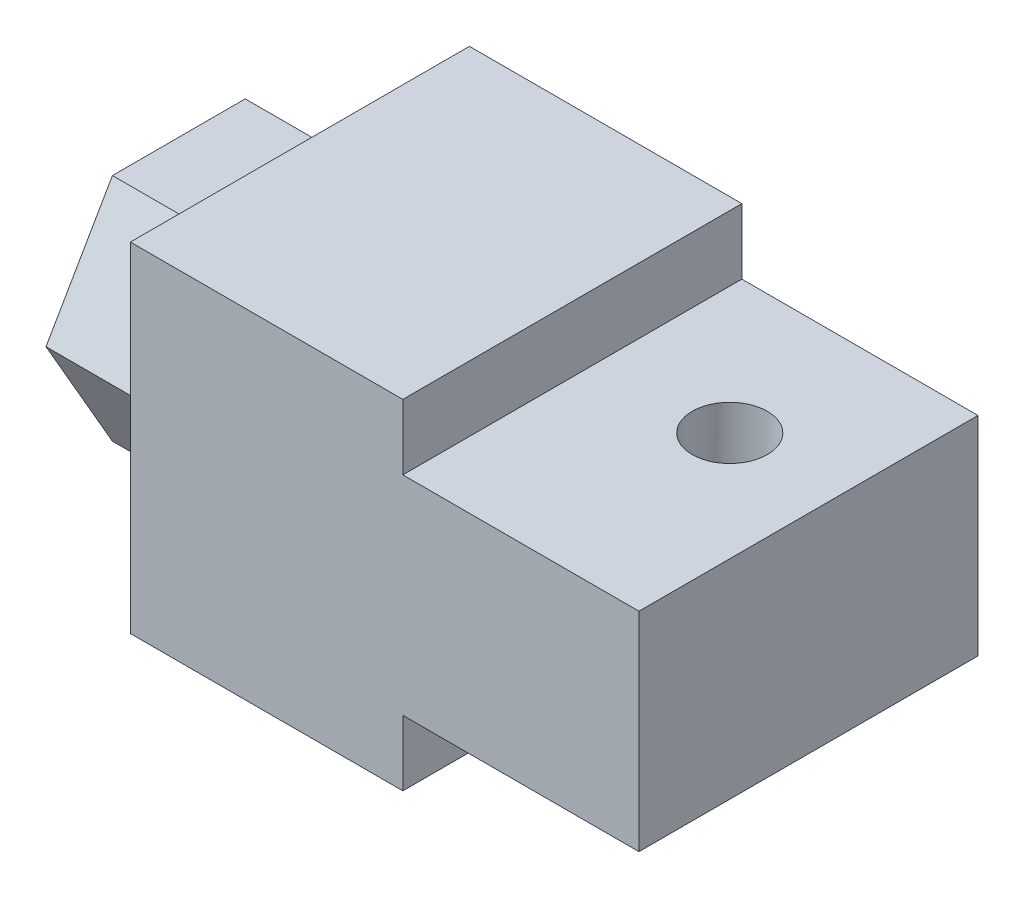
ISO-10303-21;
HEADER;
FILE_DESCRIPTION(('STEP AP214'),'2;1');
FILE_NAME('part.step','',(''),(''),'','','');
FILE_SCHEMA(('AUTOMOTIVE_DESIGN { 1 0 10303 214 1 1 1 1 }'));
ENDSEC;
DATA;
#1=APPLICATION_CONTEXT('core data for automotive mechanical design processes');
#2=APPLICATION_PROTOCOL_DEFINITION('international standard','automotive_design',2000,#1);
#3=PRODUCT_CONTEXT('',#1,'mechanical');
#4=PRODUCT('Part','Part','',(#3));
#5=PRODUCT_RELATED_PRODUCT_CATEGORY('part','',(#4));
#6=PRODUCT_DEFINITION_FORMATION('','',#4);
#7=PRODUCT_DEFINITION_CONTEXT('part definition',#1,'design');
#8=PRODUCT_DEFINITION('design','',#6,#7);
#9=PRODUCT_DEFINITION_SHAPE('','',#8);
#10=(LENGTH_UNIT() NAMED_UNIT(*) SI_UNIT(.MILLI.,.METRE.));
#11=(NAMED_UNIT(*) PLANE_ANGLE_UNIT() SI_UNIT($,.RADIAN.));
#12=(NAMED_UNIT(*) SI_UNIT($,.STERADIAN.) SOLID_ANGLE_UNIT());
#13=UNCERTAINTY_MEASURE_WITH_UNIT(LENGTH_MEASURE(1.E-05),#10,'distance_accuracy_value','');
#14=(GEOMETRIC_REPRESENTATION_CONTEXT(3) GLOBAL_UNCERTAINTY_ASSIGNED_CONTEXT((#13)) GLOBAL_UNIT_ASSIGNED_CONTEXT((#10,
#11,#12)) REPRESENTATION_CONTEXT('',''));
#15=CARTESIAN_POINT('',(0.,0.,0.));
#16=DIRECTION('',(0.,0.,1.));
#17=DIRECTION('',(1.,0.,0.));
#18=AXIS2_PLACEMENT_3D('',#15,#16,#17);
#19=CARTESIAN_POINT('',(42.,14.,14.));
#20=DIRECTION('',(0.,1.,0.));
#21=DIRECTION('',(0.,0.,-1.));
#22=AXIS2_PLACEMENT_3D('',#19,#20,#21);
#23=PLANE('',#22);
#24=DIRECTION('',(-1.,0.,0.));
#25=VECTOR('',#24,1.);
#26=CARTESIAN_POINT('',(42.,14.,14.));
#27=LINE('',#26,#25);
#28=CARTESIAN_POINT('',(22.5,14.,14.));
#29=VERTEX_POINT('',#28);
#30=CARTESIAN_POINT('',(0.,14.,14.));
#31=VERTEX_POINT('',#30);
#32=EDGE_CURVE('E23',#29,#31,#27,.T.);
#33=ORIENTED_EDGE('',*,*,#32,.F.);
#34=DIRECTION('',(0.,0.,-1.));
#35=VECTOR('',#34,1.);
#36=CARTESIAN_POINT('',(22.5,14.,14.));
#37=LINE('',#36,#35);
#38=CARTESIAN_POINT('',(22.5,14.,-14.));
#39=VERTEX_POINT('',#38);
#40=EDGE_CURVE('E193',#29,#39,#37,.T.);
#41=ORIENTED_EDGE('',*,*,#40,.T.);
#42=DIRECTION('',(-1.,0.,0.));
#43=VECTOR('',#42,1.);
#44=CARTESIAN_POINT('',(42.,14.,-14.));
#45=LINE('',#44,#43);
#46=CARTESIAN_POINT('',(0.,14.,-14.));
#47=VERTEX_POINT('',#46);
#48=EDGE_CURVE('E227',#39,#47,#45,.T.);
#49=ORIENTED_EDGE('',*,*,#48,.T.);
#50=DIRECTION('',(0.,0.,-1.));
#51=VECTOR('',#50,1.);
#52=CARTESIAN_POINT('',(0.,14.,14.));
#53=LINE('',#52,#51);
#54=EDGE_CURVE('E210',#31,#47,#53,.T.);
#55=ORIENTED_EDGE('',*,*,#54,.F.);
#56=EDGE_LOOP('',(#33,#41,#49,#55));
#57=FACE_BOUND('',#56,.T.);
#58=ADVANCED_FACE('F14',(#57),#23,.T.);
#59=CARTESIAN_POINT('',(42.,14.,14.));
#60=DIRECTION('',(0.,0.,-1.));
#61=DIRECTION('',(0.,-1.,0.));
#62=AXIS2_PLACEMENT_3D('',#59,#60,#61);
#63=PLANE('',#62);
#64=DIRECTION('',(0.,1.,0.));
#65=VECTOR('',#64,1.);
#66=CARTESIAN_POINT('',(22.5,8.6,14.));
#67=LINE('',#66,#65);
#68=CARTESIAN_POINT('',(22.5,8.6,14.));
#69=VERTEX_POINT('',#68);
#70=EDGE_CURVE('E181',#69,#29,#67,.T.);
#71=ORIENTED_EDGE('',*,*,#70,.T.);
#72=ORIENTED_EDGE('',*,*,#32,.T.);
#73=DIRECTION('',(0.,-1.,0.));
#74=VECTOR('',#73,1.);
#75=CARTESIAN_POINT('',(0.,14.,14.));
#76=LINE('',#75,#74);
#77=CARTESIAN_POINT('',(0.,-14.,14.));
#78=VERTEX_POINT('',#77);
#79=EDGE_CURVE('E219',#31,#78,#76,.T.);
#80=ORIENTED_EDGE('',*,*,#79,.T.);
#81=DIRECTION('',(-1.,0.,0.));
#82=VECTOR('',#81,1.);
#83=CARTESIAN_POINT('',(42.,-14.,14.));
#84=LINE('',#83,#82);
#85=CARTESIAN_POINT('',(22.5,-14.,14.));
#86=VERTEX_POINT('',#85);
#87=EDGE_CURVE('E231',#86,#78,#84,.T.);
#88=ORIENTED_EDGE('',*,*,#87,.F.);
#89=DIRECTION('',(0.,-1.,0.));
#90=VECTOR('',#89,1.);
#91=CARTESIAN_POINT('',(22.5,-8.6,14.));
#92=LINE('',#91,#90);
#93=CARTESIAN_POINT('',(22.5,-8.6,14.));
#94=VERTEX_POINT('',#93);
#95=EDGE_CURVE('E196',#94,#86,#92,.T.);
#96=ORIENTED_EDGE('',*,*,#95,.F.);
#97=DIRECTION('',(1.,0.,0.));
#98=VECTOR('',#97,1.);
#99=CARTESIAN_POINT('',(22.5,-8.6,14.));
#100=LINE('',#99,#98);
#101=CARTESIAN_POINT('',(42.,-8.6,14.));
#102=VERTEX_POINT('',#101);
#103=EDGE_CURVE('E198',#94,#102,#100,.T.);
#104=ORIENTED_EDGE('',*,*,#103,.T.);
#105=DIRECTION('',(0.,-1.,0.));
#106=VECTOR('',#105,1.);
#107=CARTESIAN_POINT('',(42.,14.,14.));
#108=LINE('',#107,#106);
#109=CARTESIAN_POINT('',(42.,8.6,14.));
#110=VERTEX_POINT('',#109);
#111=EDGE_CURVE('E225',#110,#102,#108,.T.);
#112=ORIENTED_EDGE('',*,*,#111,.F.);
#113=DIRECTION('',(1.,0.,0.));
#114=VECTOR('',#113,1.);
#115=CARTESIAN_POINT('',(22.5,8.6,14.));
#116=LINE('',#115,#114);
#117=EDGE_CURVE('E184',#69,#110,#116,.T.);
#118=ORIENTED_EDGE('',*,*,#117,.F.);
#119=EDGE_LOOP('',(#71,#72,#80,#88,#96,#104,#112,#118));
#120=FACE_BOUND('',#119,.T.);
#121=ADVANCED_FACE('F16',(#120),#63,.F.);
#122=CARTESIAN_POINT('',(42.,-14.,-14.));
#123=DIRECTION('',(0.,0.,1.));
#124=DIRECTION('',(0.,1.,0.));
#125=AXIS2_PLACEMENT_3D('',#122,#123,#124);
#126=PLANE('',#125);
#127=DIRECTION('',(0.,1.,0.));
#128=VECTOR('',#127,1.);
#129=CARTESIAN_POINT('',(22.5,8.6,-14.));
#130=LINE('',#129,#128);
#131=CARTESIAN_POINT('',(22.5,8.6,-14.));
#132=VERTEX_POINT('',#131);
#133=EDGE_CURVE('E186',#132,#39,#130,.T.);
#134=ORIENTED_EDGE('',*,*,#133,.F.);
#135=DIRECTION('',(1.,0.,0.));
#136=VECTOR('',#135,1.);
#137=CARTESIAN_POINT('',(22.5,8.6,-14.));
#138=LINE('',#137,#136);
#139=CARTESIAN_POINT('',(42.,8.6,-14.));
#140=VERTEX_POINT('',#139);
#141=EDGE_CURVE('E188',#132,#140,#138,.T.);
#142=ORIENTED_EDGE('',*,*,#141,.T.);
#143=DIRECTION('',(0.,1.,0.));
#144=VECTOR('',#143,1.);
#145=CARTESIAN_POINT('',(42.,-14.,-14.));
#146=LINE('',#145,#144);
#147=CARTESIAN_POINT('',(42.,-8.6,-14.));
#148=VERTEX_POINT('',#147);
#149=EDGE_CURVE('E222',#148,#140,#146,.T.);
#150=ORIENTED_EDGE('',*,*,#149,.F.);
#151=DIRECTION('',(1.,0.,0.));
#152=VECTOR('',#151,1.);
#153=CARTESIAN_POINT('',(22.5,-8.6,-14.));
#154=LINE('',#153,#152);
#155=CARTESIAN_POINT('',(22.5,-8.6,-14.));
#156=VERTEX_POINT('',#155);
#157=EDGE_CURVE('E204',#156,#148,#154,.T.);
#158=ORIENTED_EDGE('',*,*,#157,.F.);
#159=DIRECTION('',(0.,-1.,0.));
#160=VECTOR('',#159,1.);
#161=CARTESIAN_POINT('',(22.5,-8.6,-14.));
#162=LINE('',#161,#160);
#163=CARTESIAN_POINT('',(22.5,-14.,-14.));
#164=VERTEX_POINT('',#163);
#165=EDGE_CURVE('E201',#156,#164,#162,.T.);
#166=ORIENTED_EDGE('',*,*,#165,.T.);
#167=DIRECTION('',(-1.,0.,0.));
#168=VECTOR('',#167,1.);
#169=CARTESIAN_POINT('',(42.,-14.,-14.));
#170=LINE('',#169,#168);
#171=CARTESIAN_POINT('',(0.,-14.,-14.));
#172=VERTEX_POINT('',#171);
#173=EDGE_CURVE('E229',#164,#172,#170,.T.);
#174=ORIENTED_EDGE('',*,*,#173,.T.);
#175=DIRECTION('',(0.,1.,0.));
#176=VECTOR('',#175,1.);
#177=CARTESIAN_POINT('',(0.,-14.,-14.));
#178=LINE('',#177,#176);
#179=EDGE_CURVE('E213',#172,#47,#178,.T.);
#180=ORIENTED_EDGE('',*,*,#179,.T.);
#181=ORIENTED_EDGE('',*,*,#48,.F.);
#182=EDGE_LOOP('',(#134,#142,#150,#158,#166,#174,#180,#181));
#183=FACE_BOUND('',#182,.T.);
#184=ADVANCED_FACE('F263',(#183),#126,.F.);
#185=CARTESIAN_POINT('',(42.,14.,-14.));
#186=DIRECTION('',(1.,0.,0.));
#187=DIRECTION('',(0.,1.,0.));
#188=AXIS2_PLACEMENT_3D('',#185,#186,#187);
#189=PLANE('',#188);
#190=DIRECTION('',(0.,0.,-1.));
#191=VECTOR('',#190,1.);
#192=CARTESIAN_POINT('',(42.,8.6,-14.));
#193=LINE('',#192,#191);
#194=EDGE_CURVE('E38',#110,#140,#193,.T.);
#195=ORIENTED_EDGE('',*,*,#194,.F.);
#196=ORIENTED_EDGE('',*,*,#111,.T.);
#197=DIRECTION('',(0.,0.,-1.));
#198=VECTOR('',#197,1.);
#199=CARTESIAN_POINT('',(42.,-8.6,-14.));
#200=LINE('',#199,#198);
#201=EDGE_CURVE('E9',#102,#148,#200,.T.);
#202=ORIENTED_EDGE('',*,*,#201,.T.);
#203=ORIENTED_EDGE('',*,*,#149,.T.);
#204=EDGE_LOOP('',(#195,#196,#202,#203));
#205=FACE_BOUND('',#204,.T.);
#206=ADVANCED_FACE('F260',(#205),#189,.T.);
#207=CARTESIAN_POINT('',(42.,-14.,-14.));
#208=DIRECTION('',(0.,-1.,0.));
#209=DIRECTION('',(1.,0.,0.));
#210=AXIS2_PLACEMENT_3D('',#207,#208,#209);
#211=PLANE('',#210);
#212=DIRECTION('',(0.,0.,-1.));
#213=VECTOR('',#212,1.);
#214=CARTESIAN_POINT('',(22.5,-14.,-14.));
#215=LINE('',#214,#213);
#216=EDGE_CURVE('E208',#86,#164,#215,.T.);
#217=ORIENTED_EDGE('',*,*,#216,.F.);
#218=ORIENTED_EDGE('',*,*,#87,.T.);
#219=DIRECTION('',(0.,0.,1.));
#220=VECTOR('',#219,1.);
#221=CARTESIAN_POINT('',(0.,-14.,-14.));
#222=LINE('',#221,#220);
#223=EDGE_CURVE('E216',#172,#78,#222,.T.);
#224=ORIENTED_EDGE('',*,*,#223,.F.);
#225=ORIENTED_EDGE('',*,*,#173,.F.);
#226=EDGE_LOOP('',(#217,#218,#224,#225));
#227=FACE_BOUND('',#226,.T.);
#228=ADVANCED_FACE('F247',(#227),#211,.T.);
#229=CARTESIAN_POINT('',(0.,14.,-14.));
#230=DIRECTION('',(1.,0.,0.));
#231=DIRECTION('',(0.,1.,0.));
#232=AXIS2_PLACEMENT_3D('',#229,#230,#231);
#233=PLANE('',#232);
#234=DIRECTION('',(0.,0.,-1.));
#235=VECTOR('',#234,1.);
#236=CARTESIAN_POINT('',(0.,-9.5,5.48482755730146));
#237=LINE('',#236,#235);
#238=CARTESIAN_POINT('',(0.,-9.5,5.48482755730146));
#239=VERTEX_POINT('',#238);
#240=CARTESIAN_POINT('',(0.,-9.5,-5.48482755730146));
#241=VERTEX_POINT('',#240);
#242=EDGE_CURVE('E139',#239,#241,#237,.T.);
#243=ORIENTED_EDGE('',*,*,#242,.T.);
#244=DIRECTION('',(0.,0.866025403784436,-0.5));
#245=VECTOR('',#244,1.);
#246=CARTESIAN_POINT('',(0.,-9.5,-5.48482755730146));
#247=LINE('',#246,#245);
#248=CARTESIAN_POINT('',(0.,0.,-10.969655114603));
#249=VERTEX_POINT('',#248);
#250=EDGE_CURVE('E30',#241,#249,#247,.T.);
#251=ORIENTED_EDGE('',*,*,#250,.T.);
#252=DIRECTION('',(0.,-0.866025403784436,-0.5));
#253=VECTOR('',#252,1.);
#254=CARTESIAN_POINT('',(0.,9.5,-5.48482755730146));
#255=LINE('',#254,#253);
#256=CARTESIAN_POINT('',(0.,9.5,-5.48482755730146));
#257=VERTEX_POINT('',#256);
#258=EDGE_CURVE('E127',#257,#249,#255,.T.);
#259=ORIENTED_EDGE('',*,*,#258,.F.);
#260=DIRECTION('',(0.,0.,-1.));
#261=VECTOR('',#260,1.);
#262=CARTESIAN_POINT('',(0.,9.5,5.48482755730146));
#263=LINE('',#262,#261);
#264=CARTESIAN_POINT('',(0.,9.5,5.48482755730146));
#265=VERTEX_POINT('',#264);
#266=EDGE_CURVE('E132',#265,#257,#263,.T.);
#267=ORIENTED_EDGE('',*,*,#266,.F.);
#268=DIRECTION('',(0.,-0.866025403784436,0.5));
#269=VECTOR('',#268,1.);
#270=CARTESIAN_POINT('',(0.,9.5,5.48482755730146));
#271=LINE('',#270,#269);
#272=CARTESIAN_POINT('',(0.,0.,10.969655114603));
#273=VERTEX_POINT('',#272);
#274=EDGE_CURVE('E148',#265,#273,#271,.T.);
#275=ORIENTED_EDGE('',*,*,#274,.T.);
#276=DIRECTION('',(0.,0.866025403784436,0.5));
#277=VECTOR('',#276,1.);
#278=CARTESIAN_POINT('',(0.,-9.5,5.48482755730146));
#279=LINE('',#278,#277);
#280=EDGE_CURVE('E151',#239,#273,#279,.T.);
#281=ORIENTED_EDGE('',*,*,#280,.F.);
#282=EDGE_LOOP('',(#243,#251,#259,#267,#275,#281));
#283=FACE_BOUND('',#282,.T.);
#284=ORIENTED_EDGE('',*,*,#54,.T.);
#285=ORIENTED_EDGE('',*,*,#179,.F.);
#286=ORIENTED_EDGE('',*,*,#223,.T.);
#287=ORIENTED_EDGE('',*,*,#79,.F.);
#288=EDGE_LOOP('',(#284,#285,#286,#287));
#289=FACE_BOUND('',#288,.T.);
#290=ADVANCED_FACE('F135',(#283,#289),#233,.F.);
#291=CARTESIAN_POINT('',(22.5,-8.6,-14.));
#292=DIRECTION('',(-1.,0.,0.));
#293=DIRECTION('',(0.,-1.,0.));
#294=AXIS2_PLACEMENT_3D('',#291,#292,#293);
#295=PLANE('',#294);
#296=ORIENTED_EDGE('',*,*,#216,.T.);
#297=ORIENTED_EDGE('',*,*,#165,.F.);
#298=DIRECTION('',(0.,0.,1.));
#299=VECTOR('',#298,1.);
#300=CARTESIAN_POINT('',(22.5,-8.6,-14.));
#301=LINE('',#300,#299);
#302=EDGE_CURVE('E206',#156,#94,#301,.T.);
#303=ORIENTED_EDGE('',*,*,#302,.T.);
#304=ORIENTED_EDGE('',*,*,#95,.T.);
#305=EDGE_LOOP('',(#296,#297,#303,#304));
#306=FACE_BOUND('',#305,.T.);
#307=ADVANCED_FACE('F252',(#306),#295,.F.);
#308=CARTESIAN_POINT('',(22.5,-8.6,-14.));
#309=DIRECTION('',(0.,-1.,0.));
#310=DIRECTION('',(0.,0.,1.));
#311=AXIS2_PLACEMENT_3D('',#308,#309,#310);
#312=PLANE('',#311);
#313=CARTESIAN_POINT('',(33.,-8.6,-2.5));
#314=DIRECTION('',(0.,-1.,0.));
#315=DIRECTION('',(0.,0.,1.));
#316=AXIS2_PLACEMENT_3D('',#313,#314,#315);
#317=CIRCLE('',#316,3.1);
#318=CARTESIAN_POINT('',(33.,-8.6,0.6));
#319=VERTEX_POINT('',#318);
#320=EDGE_CURVE('E178',#319,#319,#317,.T.);
#321=ORIENTED_EDGE('',*,*,#320,.F.);
#322=EDGE_LOOP('',(#321));
#323=FACE_BOUND('',#322,.T.);
#324=ORIENTED_EDGE('',*,*,#103,.F.);
#325=ORIENTED_EDGE('',*,*,#302,.F.);
#326=ORIENTED_EDGE('',*,*,#157,.T.);
#327=ORIENTED_EDGE('',*,*,#201,.F.);
#328=EDGE_LOOP('',(#324,#325,#326,#327));
#329=FACE_BOUND('',#328,.T.);
#330=ADVANCED_FACE('F257',(#323,#329),#312,.T.);
#331=CARTESIAN_POINT('',(22.5,8.6,-14.));
#332=DIRECTION('',(1.,0.,0.));
#333=DIRECTION('',(0.,1.,0.));
#334=AXIS2_PLACEMENT_3D('',#331,#332,#333);
#335=PLANE('',#334);
#336=ORIENTED_EDGE('',*,*,#70,.F.);
#337=DIRECTION('',(0.,0.,1.));
#338=VECTOR('',#337,1.);
#339=CARTESIAN_POINT('',(22.5,8.6,-14.));
#340=LINE('',#339,#338);
#341=EDGE_CURVE('E190',#132,#69,#340,.T.);
#342=ORIENTED_EDGE('',*,*,#341,.F.);
#343=ORIENTED_EDGE('',*,*,#133,.T.);
#344=ORIENTED_EDGE('',*,*,#40,.F.);
#345=EDGE_LOOP('',(#336,#342,#343,#344));
#346=FACE_BOUND('',#345,.T.);
#347=ADVANCED_FACE('F266',(#346),#335,.T.);
#348=CARTESIAN_POINT('',(22.5,8.6,-14.));
#349=DIRECTION('',(0.,-1.,0.));
#350=DIRECTION('',(1.,0.,0.));
#351=AXIS2_PLACEMENT_3D('',#348,#349,#350);
#352=PLANE('',#351);
#353=CARTESIAN_POINT('',(33.,8.6,-2.5));
#354=DIRECTION('',(0.,-1.,0.));
#355=DIRECTION('',(1.,0.,0.));
#356=AXIS2_PLACEMENT_3D('',#353,#354,#355);
#357=CIRCLE('',#356,3.1);
#358=CARTESIAN_POINT('',(36.1,8.6,-2.5));
#359=VERTEX_POINT('',#358);
#360=EDGE_CURVE('E18',#359,#359,#357,.T.);
#361=ORIENTED_EDGE('',*,*,#360,.T.);
#362=EDGE_LOOP('',(#361));
#363=FACE_BOUND('',#362,.T.);
#364=ORIENTED_EDGE('',*,*,#194,.T.);
#365=ORIENTED_EDGE('',*,*,#141,.F.);
#366=ORIENTED_EDGE('',*,*,#341,.T.);
#367=ORIENTED_EDGE('',*,*,#117,.T.);
#368=EDGE_LOOP('',(#364,#365,#366,#367));
#369=FACE_BOUND('',#368,.T.);
#370=ADVANCED_FACE('F264',(#363,#369),#352,.F.);
#371=CARTESIAN_POINT('',(33.,14.,-2.5));
#372=DIRECTION('',(0.,-1.,0.));
#373=DIRECTION('',(0.,0.,1.));
#374=AXIS2_PLACEMENT_3D('',#371,#372,#373);
#375=CYLINDRICAL_SURFACE('',#374,3.1);
#376=ORIENTED_EDGE('',*,*,#320,.T.);
#377=EDGE_LOOP('',(#376));
#378=FACE_BOUND('',#377,.T.);
#379=ORIENTED_EDGE('',*,*,#360,.F.);
#380=EDGE_LOOP('',(#379));
#381=FACE_BOUND('',#380,.T.);
#382=ADVANCED_FACE('F275',(#378,#381),#375,.F.);
#383=CARTESIAN_POINT('',(-10.,-9.5,-5.48482755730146));
#384=DIRECTION('',(0.,-0.5,-0.866025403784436));
#385=DIRECTION('',(0.,-0.866025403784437,0.5));
#386=AXIS2_PLACEMENT_3D('',#383,#384,#385);
#387=PLANE('',#386);
#388=DIRECTION('',(1.,0.,0.));
#389=VECTOR('',#388,1.);
#390=CARTESIAN_POINT('',(-10.,-9.5,-5.48482755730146));
#391=LINE('',#390,#389);
#392=CARTESIAN_POINT('',(-10.,-9.5,-5.48482755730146));
#393=VERTEX_POINT('',#392);
#394=EDGE_CURVE('E176',#393,#241,#391,.T.);
#395=ORIENTED_EDGE('',*,*,#394,.F.);
#396=DIRECTION('',(0.,0.866025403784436,-0.5));
#397=VECTOR('',#396,1.);
#398=CARTESIAN_POINT('',(-10.,-9.5,-5.48482755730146));
#399=LINE('',#398,#397);
#400=CARTESIAN_POINT('',(-10.,0.,-10.969655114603));
#401=VERTEX_POINT('',#400);
#402=EDGE_CURVE('E119',#393,#401,#399,.T.);
#403=ORIENTED_EDGE('',*,*,#402,.T.);
#404=DIRECTION('',(1.,0.,0.));
#405=VECTOR('',#404,1.);
#406=CARTESIAN_POINT('',(-10.,0.,-10.969655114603));
#407=LINE('',#406,#405);
#408=EDGE_CURVE('E115',#401,#249,#407,.T.);
#409=ORIENTED_EDGE('',*,*,#408,.T.);
#410=ORIENTED_EDGE('',*,*,#250,.F.);
#411=EDGE_LOOP('',(#395,#403,#409,#410));
#412=FACE_BOUND('',#411,.T.);
#413=ADVANCED_FACE('F117',(#412),#387,.T.);
#414=CARTESIAN_POINT('',(-10.,-9.5,5.48482755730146));
#415=DIRECTION('',(0.,-1.,0.));
#416=DIRECTION('',(1.,0.,0.));
#417=AXIS2_PLACEMENT_3D('',#414,#415,#416);
#418=PLANE('',#417);
#419=DIRECTION('',(1.,0.,0.));
#420=VECTOR('',#419,1.);
#421=CARTESIAN_POINT('',(-10.,-9.5,5.48482755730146));
#422=LINE('',#421,#420);
#423=CARTESIAN_POINT('',(-10.,-9.5,5.48482755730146));
#424=VERTEX_POINT('',#423);
#425=EDGE_CURVE('E174',#424,#239,#422,.T.);
#426=ORIENTED_EDGE('',*,*,#425,.F.);
#427=DIRECTION('',(0.,0.,-1.));
#428=VECTOR('',#427,1.);
#429=CARTESIAN_POINT('',(-10.,-9.5,5.48482755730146));
#430=LINE('',#429,#428);
#431=EDGE_CURVE('E124',#424,#393,#430,.T.);
#432=ORIENTED_EDGE('',*,*,#431,.T.);
#433=ORIENTED_EDGE('',*,*,#394,.T.);
#434=ORIENTED_EDGE('',*,*,#242,.F.);
#435=EDGE_LOOP('',(#426,#432,#433,#434));
#436=FACE_BOUND('',#435,.T.);
#437=ADVANCED_FACE('F353',(#436),#418,.T.);
#438=CARTESIAN_POINT('',(-10.,-9.5,5.48482755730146));
#439=DIRECTION('',(0.,0.5,-0.866025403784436));
#440=DIRECTION('',(0.,-0.866025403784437,-0.5));
#441=AXIS2_PLACEMENT_3D('',#438,#439,#440);
#442=PLANE('',#441);
#443=DIRECTION('',(1.,0.,0.));
#444=VECTOR('',#443,1.);
#445=CARTESIAN_POINT('',(-10.,0.,10.969655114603));
#446=LINE('',#445,#444);
#447=CARTESIAN_POINT('',(-10.,0.,10.969655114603));
#448=VERTEX_POINT('',#447);
#449=EDGE_CURVE('E172',#448,#273,#446,.T.);
#450=ORIENTED_EDGE('',*,*,#449,.F.);
#451=DIRECTION('',(0.,0.866025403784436,0.5));
#452=VECTOR('',#451,1.);
#453=CARTESIAN_POINT('',(-10.,-9.5,5.48482755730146));
#454=LINE('',#453,#452);
#455=EDGE_CURVE('E164',#424,#448,#454,.T.);
#456=ORIENTED_EDGE('',*,*,#455,.F.);
#457=ORIENTED_EDGE('',*,*,#425,.T.);
#458=ORIENTED_EDGE('',*,*,#280,.T.);
#459=EDGE_LOOP('',(#450,#456,#457,#458));
#460=FACE_BOUND('',#459,.T.);
#461=ADVANCED_FACE('F361',(#460),#442,.F.);
#462=CARTESIAN_POINT('',(-10.,9.5,5.48482755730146));
#463=DIRECTION('',(0.,0.5,0.866025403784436));
#464=DIRECTION('',(0.,0.866025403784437,-0.5));
#465=AXIS2_PLACEMENT_3D('',#462,#463,#464);
#466=PLANE('',#465);
#467=DIRECTION('',(1.,0.,0.));
#468=VECTOR('',#467,1.);
#469=CARTESIAN_POINT('',(-10.,9.5,5.48482755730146));
#470=LINE('',#469,#468);
#471=CARTESIAN_POINT('',(-10.,9.5,5.48482755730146));
#472=VERTEX_POINT('',#471);
#473=EDGE_CURVE('E170',#472,#265,#470,.T.);
#474=ORIENTED_EDGE('',*,*,#473,.F.);
#475=DIRECTION('',(0.,-0.866025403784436,0.5));
#476=VECTOR('',#475,1.);
#477=CARTESIAN_POINT('',(-10.,9.5,5.48482755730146));
#478=LINE('',#477,#476);
#479=EDGE_CURVE('E161',#472,#448,#478,.T.);
#480=ORIENTED_EDGE('',*,*,#479,.T.);
#481=ORIENTED_EDGE('',*,*,#449,.T.);
#482=ORIENTED_EDGE('',*,*,#274,.F.);
#483=EDGE_LOOP('',(#474,#480,#481,#482));
#484=FACE_BOUND('',#483,.T.);
#485=ADVANCED_FACE('F370',(#484),#466,.T.);
#486=CARTESIAN_POINT('',(-10.,9.5,5.48482755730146));
#487=DIRECTION('',(0.,-1.,0.));
#488=DIRECTION('',(1.,0.,0.));
#489=AXIS2_PLACEMENT_3D('',#486,#487,#488);
#490=PLANE('',#489);
#491=DIRECTION('',(1.,0.,0.));
#492=VECTOR('',#491,1.);
#493=CARTESIAN_POINT('',(-10.,9.5,-5.48482755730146));
#494=LINE('',#493,#492);
#495=CARTESIAN_POINT('',(-10.,9.5,-5.48482755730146));
#496=VERTEX_POINT('',#495);
#497=EDGE_CURVE('E123',#496,#257,#494,.T.);
#498=ORIENTED_EDGE('',*,*,#497,.F.);
#499=DIRECTION('',(0.,0.,-1.));
#500=VECTOR('',#499,1.);
#501=CARTESIAN_POINT('',(-10.,9.5,5.48482755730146));
#502=LINE('',#501,#500);
#503=EDGE_CURVE('E158',#472,#496,#502,.T.);
#504=ORIENTED_EDGE('',*,*,#503,.F.);
#505=ORIENTED_EDGE('',*,*,#473,.T.);
#506=ORIENTED_EDGE('',*,*,#266,.T.);
#507=EDGE_LOOP('',(#498,#504,#505,#506));
#508=FACE_BOUND('',#507,.T.);
#509=ADVANCED_FACE('F379',(#508),#490,.F.);
#510=CARTESIAN_POINT('',(-10.,9.5,-5.48482755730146));
#511=DIRECTION('',(0.,-0.5,0.866025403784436));
#512=DIRECTION('',(0.,0.866025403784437,0.5));
#513=AXIS2_PLACEMENT_3D('',#510,#511,#512);
#514=PLANE('',#513);
#515=DIRECTION('',(0.,-0.866025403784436,-0.5));
#516=VECTOR('',#515,1.);
#517=CARTESIAN_POINT('',(-10.,9.5,-5.48482755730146));
#518=LINE('',#517,#516);
#519=EDGE_CURVE('E156',#496,#401,#518,.T.);
#520=ORIENTED_EDGE('',*,*,#519,.F.);
#521=ORIENTED_EDGE('',*,*,#497,.T.);
#522=ORIENTED_EDGE('',*,*,#258,.T.);
#523=ORIENTED_EDGE('',*,*,#408,.F.);
#524=EDGE_LOOP('',(#520,#521,#522,#523));
#525=FACE_BOUND('',#524,.T.);
#526=ADVANCED_FACE('F128',(#525),#514,.F.);
#527=CARTESIAN_POINT('',(-10.,0.,-10.969655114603));
#528=DIRECTION('',(-1.,0.,0.));
#529=DIRECTION('',(0.,-1.,0.));
#530=AXIS2_PLACEMENT_3D('',#527,#528,#529);
#531=PLANE('',#530);
#532=CARTESIAN_POINT('',(-10.,0.,0.));
#533=DIRECTION('',(-1.,0.,0.));
#534=DIRECTION('',(0.,-1.,0.));
#535=AXIS2_PLACEMENT_3D('',#532,#533,#534);
#536=CIRCLE('',#535,6.);
#537=CARTESIAN_POINT('',(-10.,-6.,0.));
#538=VERTEX_POINT('',#537);
#539=EDGE_CURVE('E140',#538,#538,#536,.T.);
#540=ORIENTED_EDGE('',*,*,#539,.F.);
#541=EDGE_LOOP('',(#540));
#542=FACE_BOUND('',#541,.T.);
#543=ORIENTED_EDGE('',*,*,#402,.F.);
#544=ORIENTED_EDGE('',*,*,#431,.F.);
#545=ORIENTED_EDGE('',*,*,#455,.T.);
#546=ORIENTED_EDGE('',*,*,#479,.F.);
#547=ORIENTED_EDGE('',*,*,#503,.T.);
#548=ORIENTED_EDGE('',*,*,#519,.T.);
#549=EDGE_LOOP('',(#543,#544,#545,#546,#547,#548));
#550=FACE_BOUND('',#549,.T.);
#551=ADVANCED_FACE('F390',(#542,#550),#531,.T.);
#552=CARTESIAN_POINT('',(12.5,0.,0.));
#553=DIRECTION('',(-1.,0.,0.));
#554=DIRECTION('',(0.,-1.,0.));
#555=AXIS2_PLACEMENT_3D('',#552,#553,#554);
#556=CYLINDRICAL_SURFACE('',#555,6.);
#557=CARTESIAN_POINT('',(17.,0.,0.));
#558=DIRECTION('',(-1.,0.,0.));
#559=DIRECTION('',(0.,0.,1.));
#560=AXIS2_PLACEMENT_3D('',#557,#558,#559);
#561=CIRCLE('',#560,6.);
#562=CARTESIAN_POINT('',(17.,0.,6.));
#563=VERTEX_POINT('',#562);
#564=EDGE_CURVE('E143',#563,#563,#561,.T.);
#565=ORIENTED_EDGE('',*,*,#564,.F.);
#566=EDGE_LOOP('',(#565));
#567=FACE_BOUND('',#566,.T.);
#568=ORIENTED_EDGE('',*,*,#539,.T.);
#569=EDGE_LOOP('',(#568));
#570=FACE_BOUND('',#569,.T.);
#571=ADVANCED_FACE('F398',(#567,#570),#556,.F.);
#572=CARTESIAN_POINT('',(17.,0.,0.));
#573=DIRECTION('',(-1.,0.,0.));
#574=DIRECTION('',(0.,0.,1.));
#575=AXIS2_PLACEMENT_3D('',#572,#573,#574);
#576=PLANE('',#575);
#577=ORIENTED_EDGE('',*,*,#564,.T.);
#578=EDGE_LOOP('',(#577));
#579=FACE_BOUND('',#578,.T.);
#580=ADVANCED_FACE('F413',(#579),#576,.T.);
#581=CLOSED_SHELL('',(#58,#121,#184,#206,#228,#290,#307,#330,#347,#370,#382,#413,#437,#461,#485,
#509,#526,#551,#571,#580));
#582=MANIFOLD_SOLID_BREP('B1',#581);
#583=ADVANCED_BREP_SHAPE_REPRESENTATION('',(#18,#582),#14);
#584=SHAPE_DEFINITION_REPRESENTATION(#9,#583);
ENDSEC;
END-ISO-10303-21;
